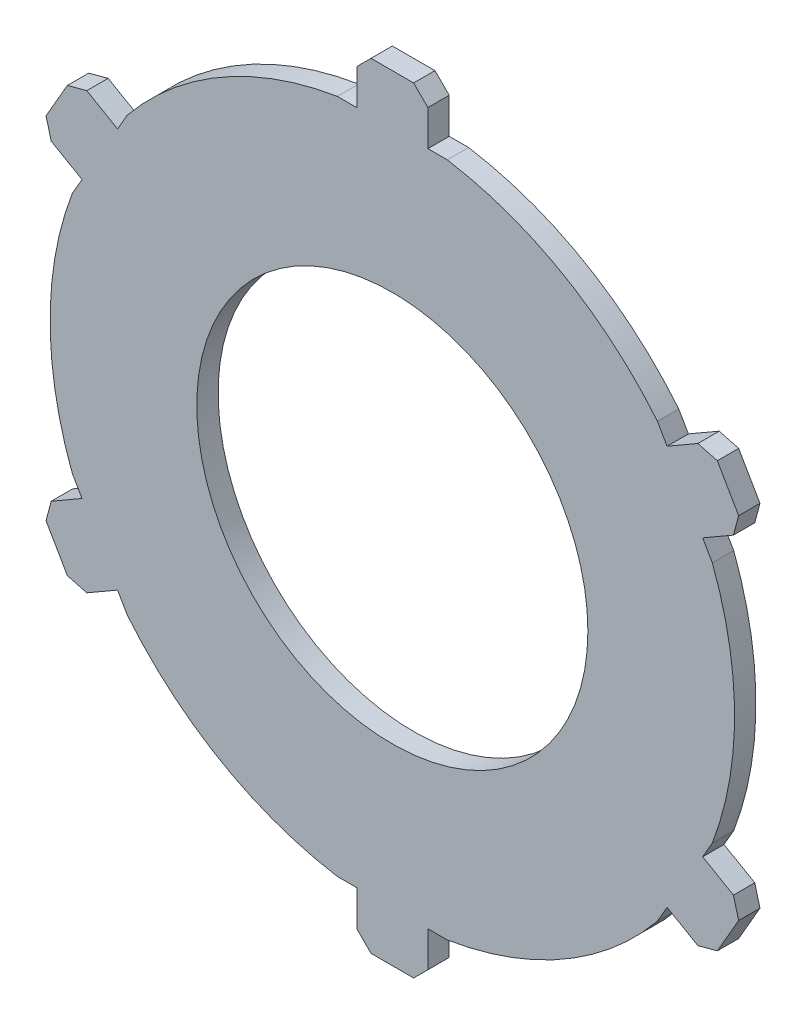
from build123d import *

# Parameters (mm, degrees)
ESQUISSE1_R                  = 110
EXTRUSION1_DEPTH             = 12
ESQUISSE2_W                  = 31.239797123
ESQUISSE2_H                  = 20
ESQUISSE2_W_2                = 33.218163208
ENL_V_MAT_EXTRU_1_DEPTH      = 12
R_P_TITION_CIRCULAIRE1_COUNT = 6


with BuildPart() as part:
    # Esquisse1 → Extrusion1 (new body)
    with BuildSketch(Plane.XY):
        with BuildLine():
            Line((-20, 210), (-12, 218))
            Line((-12, 218), (12, 218))
            Line((12, 218), (20, 210))
            Line((20, 210), (20, 191.458219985))
            ThreePointArc((20, 191.458219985), (96.25, 166.709890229), (155.807682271, 113.049618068))
            Line((155.807682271, 113.049618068), (171.865334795, 122.320508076))
            Line((171.865334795, 122.320508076), (182.793538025, 119.392304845))
            Line((182.793538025, 119.392304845), (194.793538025, 98.607695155))
            Line((194.793538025, 98.607695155), (191.865334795, 87.679491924))
            Line((191.865334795, 87.679491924), (175.807682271, 78.408601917))
            ThreePointArc((175.807682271, 78.408601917), (192.5, 0), (175.807682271, -78.408601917))
            Line((175.807682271, -78.408601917), (191.865334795, -87.679491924))
            Line((191.865334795, -87.679491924), (194.793538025, -98.607695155))
            Line((194.793538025, -98.607695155), (182.793538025, -119.392304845))
            Line((182.793538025, -119.392304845), (171.865334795, -122.320508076))
            Line((171.865334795, -122.320508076), (155.807682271, -113.049618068))
            ThreePointArc((155.807682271, -113.049618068), (96.25, -166.709890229), (20, -191.458219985))
            Line((20, -191.458219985), (20, -210))
            Line((20, -210), (12, -218))
            Line((12, -218), (-12, -218))
            Line((-12, -218), (-20, -210))
            Line((-20, -210), (-20, -191.458219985))
            ThreePointArc((-20, -191.458219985), (-96.25, -166.709890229), (-155.807682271, -113.049618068))
            Line((-155.807682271, -113.049618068), (-171.865334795, -122.320508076))
            Line((-171.865334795, -122.320508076), (-182.793538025, -119.392304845))
            Line((-182.793538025, -119.392304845), (-194.793538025, -98.607695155))
            Line((-194.793538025, -98.607695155), (-191.865334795, -87.679491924))
            Line((-191.865334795, -87.679491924), (-175.807682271, -78.408601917))
            ThreePointArc((-175.807682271, -78.408601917), (-192.5, 0), (-175.807682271, 78.408601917))
            Line((-175.807682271, 78.408601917), (-191.865334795, 87.679491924))
            Line((-191.865334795, 87.679491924), (-194.793538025, 98.607695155))
            Line((-194.793538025, 98.607695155), (-182.793538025, 119.392304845))
            Line((-182.793538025, 119.392304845), (-171.865334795, 122.320508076))
            Line((-171.865334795, 122.320508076), (-155.807682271, 113.049618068))
            ThreePointArc((-155.807682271, 113.049618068), (-96.25, 166.709890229), (-20, 191.458219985))
            Line((-20, 191.458219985), (-20, 210))
        make_face()
        Circle(ESQUISSE1_R, mode=Mode.SUBTRACT)
    extrude(amount=EXTRUSION1_DEPTH)

    # Esquisse2 → Enl_v. mat.-Extru.1 (cut)
    with BuildSketch(Plane.XY.offset(12)):
        with Locations((-35.619898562, 200)):
            Rectangle(ESQUISSE2_W, ESQUISSE2_H)
        with Locations((36.609081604, 200)):
            Rectangle(ESQUISSE2_W_2, ESQUISSE2_H)
    enl_v_mat_extru_1 = extrude(amount=-ENL_V_MAT_EXTRU_1_DEPTH, mode=Mode.SUBTRACT)

    # R_p_tition circulaire1: Enl_v. mat.-Extru.1 ×6 about axis
    r_p_tition_circulaire1_axis = Axis((0, 0, 0), (0, 0, 1))
    for i in range(1, R_P_TITION_CIRCULAIRE1_COUNT):
        add(enl_v_mat_extru_1.rotate(r_p_tition_circulaire1_axis, i * 360 / R_P_TITION_CIRCULAIRE1_COUNT), mode=Mode.SUBTRACT)


solid = part.part
